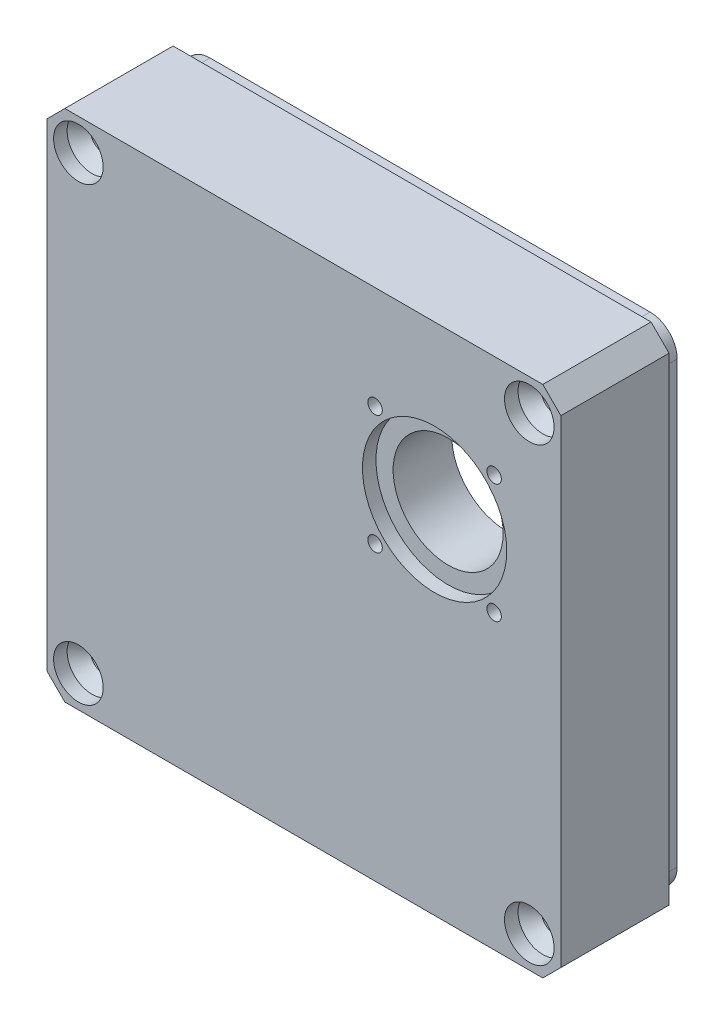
from build123d import *

# Parameters (mm, degrees)
EXTRUDE_1_DEPTH               = 14
CUT_EXTRUDE_1_DEPTH           = 2
SKETCH_6_R                    = 6.1
CUT_EXTRUDE_3_DEPTH           = 43.667317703
HOLE_WIZARD_M21_D             = 1.6
HOLE_WIZARD_M21_DEPTH         = 6.5
HOLE_WIZARD_M21_TIP           = 0.480688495
SKETCH_11_W                   = 47
SKETCH_11_H                   = 47
CUT_EXTRUDE_4_DEPTH           = 6
CHAMFER_1_SIZE                = 5
FILLET_1_R                    = 4
SKETCH_12_R                   = 8
SKETCH_12_R_2                 = 6
CUT_EXTRUDE_5_DEPTH           = 1.5
CUT_EXTRUDE_START             = -5
CUT_EXTRUDE_6_DEPTH           = 5
HOLE_WIZARD_M2_51_D           = 2.9
HOLE_WIZARD_M2_51_CSINK_D     = 5.5
HOLE_WIZARD_M2_51_CSINK_ANGLE = 90
HOLE_WIZARD_M2_51_2_D         = 2.05
HOLE_WIZARD_M2_51_2_DEPTH     = 6.5
HOLE_WIZARD_M2_51_2_TIP       = 0.615882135
HOLE_WIZARD_5_5_5_5_1_D       = 5.5
HOLE_WIZARD_5_5_5_5_1_DEPTH   = 1.5
HOLE_WIZARD_5_5_5_5_1_TIP     = 2.75


with BuildPart() as part:
    # Sketch 1 → Extrude 1 (new body)
    with BuildSketch(Plane.XY):
        Polygon((-28.5, 26.5), (-26.5, 28.5), (26.5, 28.5), (28.5, 26.5), (28.5, -26.5), (26.5, -28.5), (-26.5, -28.5), (-28.5, -26.5), align=None)
    extrude(amount=EXTRUDE_1_DEPTH)

    # Sketch 2 → Cut-Extrude 1 (cut)
    with BuildSketch(Plane(origin=(0, 0, 0), x_dir=(-1, 0, 0), z_dir=(0, 0, -1))):
        Polygon((-26.5, -28.5), (-28.5, -26.5), (-28.5, 26.5), (-26.5, 28.5), (26.5, 28.5), (28.5, 26.5), (28.5, -26.5), (26.5, -28.5), align=None)
        with BuildLine():
            Line((-24.4, -27.4), (24.4, -27.4))
            ThreePointArc((24.4, -27.4), (26.521320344, -26.521320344), (27.4, -24.4))
            Line((27.4, -24.4), (27.4, 24.4))
            ThreePointArc((27.4, 24.4), (26.521320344, 26.521320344), (24.4, 27.4))
            Line((24.4, 27.4), (-24.4, 27.4))
            ThreePointArc((-24.4, 27.4), (-26.521320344, 26.521320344), (-27.4, 24.4))
            Line((-27.4, 24.4), (-27.4, -24.4))
            ThreePointArc((-27.4, -24.4), (-26.521320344, -26.521320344), (-24.4, -27.4))
        make_face(mode=Mode.SUBTRACT)
    extrude(amount=-CUT_EXTRUDE_1_DEPTH, mode=Mode.SUBTRACT)

    # Sketch 6 → Cut-Extrude 3 (cut, through all)
    with BuildSketch(Plane(origin=(0, 0, 0), x_dir=(-1, 0, 0), z_dir=(0, 0, -1))):
        with Locations((-14.5, 10.5)):
            Circle(SKETCH_6_R)
    extrude(amount=-CUT_EXTRUDE_3_DEPTH, mode=Mode.SUBTRACT)

    # Hole Wizard M21
    with Locations(Plane.XY.offset(14)):
        with Locations((7.9, 3.9), (7.9, 17.1), (21.1, 17.1), (21.1, 3.9)):
            Hole(HOLE_WIZARD_M21_D / 2, depth=HOLE_WIZARD_M21_DEPTH)
            with Locations((0, 0, -(HOLE_WIZARD_M21_DEPTH + HOLE_WIZARD_M21_TIP / 2))):  # 118° drill point
                Cone(0, HOLE_WIZARD_M21_D / 2, HOLE_WIZARD_M21_TIP, mode=Mode.SUBTRACT)

    # Sketch 11 → Cut-Extrude 4 (cut)
    with BuildSketch(Plane(origin=(0, 0, 0), x_dir=(-1, 0, 0), z_dir=(0, 0, -1))):
        Rectangle(SKETCH_11_W, SKETCH_11_H)
    extrude(amount=-CUT_EXTRUDE_4_DEPTH, mode=Mode.SUBTRACT)

    # Chamfer 1
    chamfer_1_edges = [part.edges().sort_by_distance(p)[0] for p in [
        (-23.5, 23.5, 3),
        (-23.5, -23.5, 3),
        (23.5, -23.5, 3),
        (23.5, 23.5, 3),
    ]]
    chamfer(chamfer_1_edges, length=CHAMFER_1_SIZE)

    # Fillet 1
    fillet_1_edges = [part.edges().sort_by_distance(p)[0] for p in [
        (-23.5, 18.5, 3),
        (-23.5, -18.5, 3),
        (18.5, -23.5, 3),
        (-18.5, -23.5, 3),
        (23.5, -18.5, 3),
        (23.5, 18.5, 3),
        (-18.5, 23.5, 3),
        (18.5, 23.5, 3),
    ]]
    fillet(fillet_1_edges, radius=FILLET_1_R)

    # Sketch 12 → Cut-Extrude 5 (cut)
    with BuildSketch(Plane.XY.offset(14)):
        with Locations((14.5, 10.5)):
            Circle(SKETCH_12_R)
        with Locations((14.5, 10.5)):
            Circle(SKETCH_12_R_2, mode=Mode.SUBTRACT)
    extrude(amount=-CUT_EXTRUDE_5_DEPTH, mode=Mode.SUBTRACT)

    # Sketch 15 → Cut-Extrude 6 (cut)
    with BuildSketch(Plane(origin=(0, 0, 6), x_dir=(-1, 0, 0), z_dir=(0, 0, -1)).offset(CUT_EXTRUDE_START)):
        with BuildLine():
            Line((-23.5, -9.5), (-23.5, -16.843145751))
            ThreePointArc((-23.5, -16.843145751), (-23.19551813, -18.37387948), (-22.328427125, -19.671572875))
            Line((-22.328427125, -19.671572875), (-19.671572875, -22.328427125))
            ThreePointArc((-19.671572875, -22.328427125), (-18.37387948, -23.19551813), (-16.843145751, -23.5))
            Line((-16.843145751, -23.5), (16.843145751, -23.5))
            ThreePointArc((16.843145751, -23.5), (18.37387948, -23.19551813), (19.671572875, -22.328427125))
            Line((19.671572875, -22.328427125), (22.328427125, -19.671572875))
            ThreePointArc((22.328427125, -19.671572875), (23.19551813, -18.37387948), (23.5, -16.843145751))
            Line((23.5, -16.843145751), (23.5, 16.843145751))
            ThreePointArc((23.5, 16.843145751), (23.19551813, 18.37387948), (22.328427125, 19.671572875))
            Line((22.328427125, 19.671572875), (19.671572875, 22.328427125))
            ThreePointArc((19.671572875, 22.328427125), (18.37387948, 23.19551813), (16.843145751, 23.5))
            Line((16.843145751, 23.5), (-1.5, 23.5))
            ThreePointArc((-1.5, 23.5), (-4.328427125, 22.328427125), (-5.5, 19.5))
            Line((-5.5, 19.5), (-5.5, -5.5))
            Line((-5.5, -5.5), (-19.5, -5.5))
            ThreePointArc((-19.5, -5.5), (-22.328427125, -6.671572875), (-23.5, -9.5))
        make_face()
    extrude(amount=CUT_EXTRUDE_6_DEPTH, mode=Mode.SUBTRACT)

    # Hole Wizard M2.51 (through all)
    with Locations(Plane.XY.offset(14)):
        with Locations((-25, 25), (25, 25), (25, -25), (-25, -25)):
            CounterSinkHole(HOLE_WIZARD_M2_51_D / 2, HOLE_WIZARD_M2_51_CSINK_D / 2, counter_sink_angle=HOLE_WIZARD_M2_51_CSINK_ANGLE)

    # Hole Wizard M2.51 2
    with Locations(Plane(origin=(0, 0, 6), x_dir=(-1, 0, 0), z_dir=(0, 0, -1))):
        with Locations((-10, -0.5)):
            Hole(HOLE_WIZARD_M2_51_2_D / 2, depth=HOLE_WIZARD_M2_51_2_DEPTH)
            with Locations((0, 0, -(HOLE_WIZARD_M2_51_2_DEPTH + HOLE_WIZARD_M2_51_2_TIP / 2))):  # 118° drill point
                Cone(0, HOLE_WIZARD_M2_51_2_D / 2, HOLE_WIZARD_M2_51_2_TIP, mode=Mode.SUBTRACT)

    # Hole Wizard 5.5 _5.5_1
    with Locations(Plane.XY.offset(14)):
        with Locations((-25, 25), (-25, -25), (25, -25), (25, 25)):
            Hole(HOLE_WIZARD_5_5_5_5_1_D / 2, depth=HOLE_WIZARD_5_5_5_5_1_DEPTH)
            with Locations((0, 0, -(HOLE_WIZARD_5_5_5_5_1_DEPTH + HOLE_WIZARD_5_5_5_5_1_TIP / 2))):  # 90° drill point
                Cone(0, HOLE_WIZARD_5_5_5_5_1_D / 2, HOLE_WIZARD_5_5_5_5_1_TIP, mode=Mode.SUBTRACT)


solid = part.part
